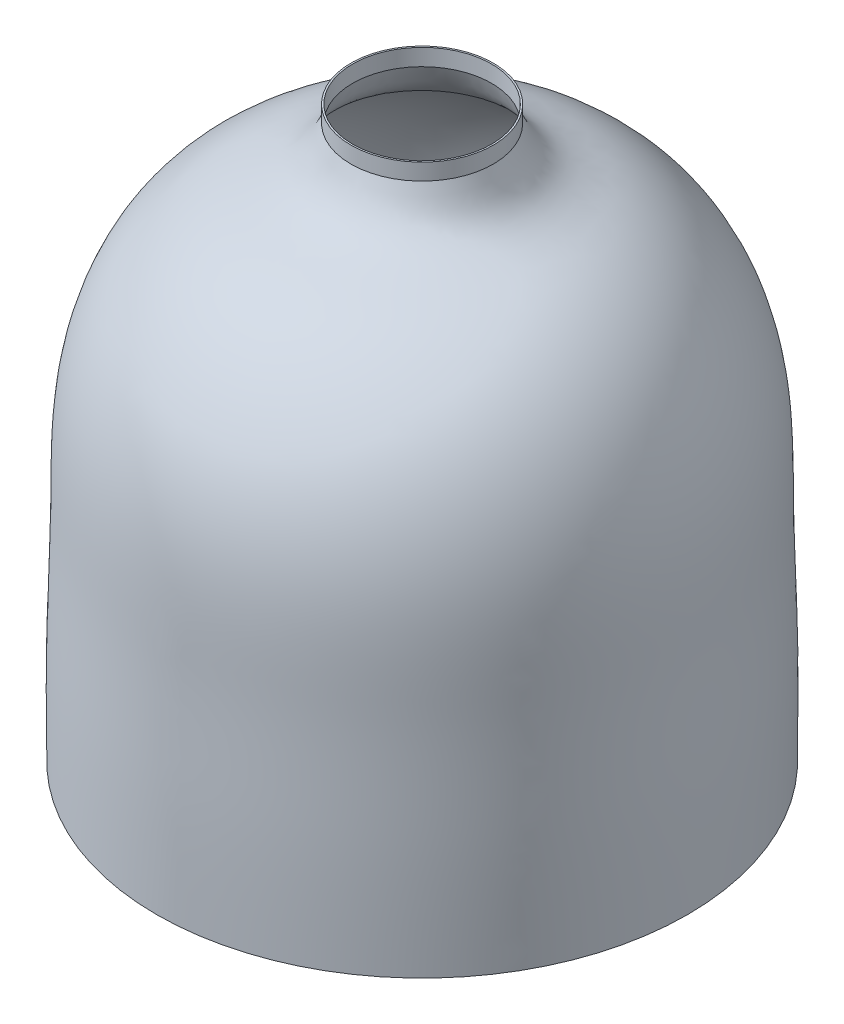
ISO-10303-21;
HEADER;
FILE_DESCRIPTION(('STEP AP214'),'2;1');
FILE_NAME('part.step','',(''),(''),'','','');
FILE_SCHEMA(('AUTOMOTIVE_DESIGN { 1 0 10303 214 1 1 1 1 }'));
ENDSEC;
DATA;
#1=APPLICATION_CONTEXT('core data for automotive mechanical design processes');
#2=APPLICATION_PROTOCOL_DEFINITION('international standard','automotive_design',2000,#1);
#3=PRODUCT_CONTEXT('',#1,'mechanical');
#4=PRODUCT('Part','Part','',(#3));
#5=PRODUCT_RELATED_PRODUCT_CATEGORY('part','',(#4));
#6=PRODUCT_DEFINITION_FORMATION('','',#4);
#7=PRODUCT_DEFINITION_CONTEXT('part definition',#1,'design');
#8=PRODUCT_DEFINITION('design','',#6,#7);
#9=PRODUCT_DEFINITION_SHAPE('','',#8);
#10=(LENGTH_UNIT() NAMED_UNIT(*) SI_UNIT(.MILLI.,.METRE.));
#11=(NAMED_UNIT(*) PLANE_ANGLE_UNIT() SI_UNIT($,.RADIAN.));
#12=(NAMED_UNIT(*) SI_UNIT($,.STERADIAN.) SOLID_ANGLE_UNIT());
#13=UNCERTAINTY_MEASURE_WITH_UNIT(LENGTH_MEASURE(1.E-05),#10,'distance_accuracy_value','');
#14=(GEOMETRIC_REPRESENTATION_CONTEXT(3) GLOBAL_UNCERTAINTY_ASSIGNED_CONTEXT((#13)) GLOBAL_UNIT_ASSIGNED_CONTEXT((#10,
#11,#12)) REPRESENTATION_CONTEXT('',''));
#15=CARTESIAN_POINT('',(0.,0.,0.));
#16=DIRECTION('',(0.,0.,1.));
#17=DIRECTION('',(1.,0.,0.));
#18=AXIS2_PLACEMENT_3D('',#15,#16,#17);
#19=CARTESIAN_POINT('',(0.,0.,0.));
#20=DIRECTION('',(0.,1.,0.));
#21=DIRECTION('',(0.,0.,1.));
#22=AXIS2_PLACEMENT_3D('',#19,#20,#21);
#23=CYLINDRICAL_SURFACE('',#22,13.);
#24=CARTESIAN_POINT('',(0.,0.,0.));
#25=DIRECTION('',(0.,1.,0.));
#26=DIRECTION('',(0.,0.,1.));
#27=AXIS2_PLACEMENT_3D('',#24,#25,#26);
#28=CIRCLE('',#27,13.);
#29=CARTESIAN_POINT('',(0.,0.,13.));
#30=VERTEX_POINT('',#29);
#31=EDGE_CURVE('E51',#30,#30,#28,.T.);
#32=ORIENTED_EDGE('',*,*,#31,.F.);
#33=EDGE_LOOP('',(#32));
#34=FACE_BOUND('',#33,.T.);
#35=CARTESIAN_POINT('',(0.,-3.,0.));
#36=DIRECTION('',(0.,1.,0.));
#37=DIRECTION('',(0.,0.,1.));
#38=AXIS2_PLACEMENT_3D('',#35,#36,#37);
#39=CIRCLE('',#38,13.);
#40=CARTESIAN_POINT('',(0.,-3.,13.));
#41=VERTEX_POINT('',#40);
#42=EDGE_CURVE('E10',#41,#41,#39,.T.);
#43=ORIENTED_EDGE('',*,*,#42,.T.);
#44=EDGE_LOOP('',(#43));
#45=FACE_BOUND('',#44,.T.);
#46=ADVANCED_FACE('F29',(#34,#45),#23,.T.);
#47=CARTESIAN_POINT('',(48.5,-104.,0.));
#48=CARTESIAN_POINT('',(48.5601417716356,-97.3319373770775,0.));
#49=CARTESIAN_POINT('',(48.6804441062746,-83.9937286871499,0.));
#50=CARTESIAN_POINT('',(47.7776787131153,-64.0042717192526,0.));
#51=CARTESIAN_POINT('',(48.2064747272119,-44.0251845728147,0.));
#52=CARTESIAN_POINT('',(41.718061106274,-25.1285380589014,0.));
#53=CARTESIAN_POINT('',(28.9379282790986,-13.6997989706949,0.));
#54=CARTESIAN_POINT('',(15.9556062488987,-10.6479940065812,0.));
#55=CARTESIAN_POINT('',(13.6968422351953,-4.80316482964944,0.));
#56=CARTESIAN_POINT('',(13.,-3.,0.));
#57=B_SPLINE_CURVE_WITH_KNOTS('',3,(#47,#48,#49,#50,#51,#52,#53,#54,#55,#56),.UNSPECIFIED.,.F.,
.F.,(4,1,1,1,1,1,1,4),(0.,0.172912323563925,0.345878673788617,0.519007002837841,
0.690017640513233,0.843340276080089,0.951669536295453,1.),.UNSPECIFIED.);
#58=CARTESIAN_POINT('',(0.,0.,0.));
#59=DIRECTION('',(0.,1.,0.));
#60=AXIS1_PLACEMENT('',#58,#59);
#61=SURFACE_OF_REVOLUTION('',#57,#60);
#62=ORIENTED_EDGE('',*,*,#42,.F.);
#63=EDGE_LOOP('',(#62));
#64=FACE_BOUND('',#63,.T.);
#65=CARTESIAN_POINT('',(0.,-104.,0.));
#66=DIRECTION('',(0.,1.,0.));
#67=DIRECTION('',(0.,0.,1.));
#68=AXIS2_PLACEMENT_3D('',#65,#66,#67);
#69=CIRCLE('',#68,48.5);
#70=CARTESIAN_POINT('',(0.,-104.,48.5));
#71=VERTEX_POINT('',#70);
#72=EDGE_CURVE('E35',#71,#71,#69,.T.);
#73=ORIENTED_EDGE('',*,*,#72,.T.);
#74=EDGE_LOOP('',(#73));
#75=FACE_BOUND('',#74,.T.);
#76=ADVANCED_FACE('F64',(#64,#75),#61,.T.);
#77=CARTESIAN_POINT('',(0.,-104.,0.));
#78=DIRECTION('',(0.,-1.,0.));
#79=DIRECTION('',(0.,0.,-1.));
#80=AXIS2_PLACEMENT_3D('',#77,#78,#79);
#81=CONICAL_SURFACE('',#80,48.5,1.56177719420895);
#82=CARTESIAN_POINT('',(0.,-103.997294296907,0.));
#83=DIRECTION('',(0.,1.,0.));
#84=DIRECTION('',(0.,0.,1.));
#85=AXIS2_PLACEMENT_3D('',#82,#83,#84);
#86=CIRCLE('',#85,48.2000122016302);
#87=CARTESIAN_POINT('',(0.,-103.997294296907,48.2000122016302));
#88=VERTEX_POINT('',#87);
#89=EDGE_CURVE('E39',#88,#88,#86,.T.);
#90=ORIENTED_EDGE('',*,*,#89,.T.);
#91=EDGE_LOOP('',(#90));
#92=FACE_BOUND('',#91,.T.);
#93=ORIENTED_EDGE('',*,*,#72,.F.);
#94=EDGE_LOOP('',(#93));
#95=FACE_BOUND('',#94,.T.);
#96=ADVANCED_FACE('F67',(#92,#95),#81,.F.);
#97=CARTESIAN_POINT('',(48.2000122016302,-103.997294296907,0.));
#98=CARTESIAN_POINT('',(48.2435095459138,-99.1746392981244,0.));
#99=CARTESIAN_POINT('',(48.286984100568,-94.353398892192,0.));
#100=CARTESIAN_POINT('',(48.249864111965,-87.1260407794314,0.));
#101=CARTESIAN_POINT('',(48.2192849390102,-84.7180573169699,0.));
#102=CARTESIAN_POINT('',(48.1123062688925,-79.9020435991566,0.));
#103=CARTESIAN_POINT('',(47.9670502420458,-75.0852195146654,0.));
#104=CARTESIAN_POINT('',(47.8212442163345,-70.2639990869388,0.));
#105=CARTESIAN_POINT('',(47.7402413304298,-66.6453941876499,0.));
#106=CARTESIAN_POINT('',(47.7179662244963,-65.4387442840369,0.));
#107=CARTESIAN_POINT('',(47.6876343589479,-63.0243749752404,0.));
#108=CARTESIAN_POINT('',(47.6801824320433,-61.8173099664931,0.));
#109=CARTESIAN_POINT('',(47.6399389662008,-55.7861154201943,0.));
#110=CARTESIAN_POINT('',(47.5969630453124,-50.9729521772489,0.));
#111=CARTESIAN_POINT('',(46.8605247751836,-45.0021047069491,0.));
#112=CARTESIAN_POINT('',(46.6785386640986,-43.8097866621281,0.));
#113=CARTESIAN_POINT('',(46.2328803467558,-41.4322331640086,0.));
#114=CARTESIAN_POINT('',(45.9701485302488,-40.2478815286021,0.));
#115=CARTESIAN_POINT('',(45.0567603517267,-36.7263071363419,0.));
#116=CARTESIAN_POINT('',(44.2808971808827,-34.4205892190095,0.));
#117=CARTESIAN_POINT('',(42.3664121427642,-29.9898237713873,0.));
#118=CARTESIAN_POINT('',(41.2278113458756,-27.8647997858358,0.));
#119=CARTESIAN_POINT('',(38.5592064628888,-23.8910558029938,0.));
#120=CARTESIAN_POINT('',(37.0281434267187,-22.0418516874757,0.));
#121=CARTESIAN_POINT('',(33.584282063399,-18.7053336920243,0.));
#122=CARTESIAN_POINT('',(31.6715676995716,-17.2180371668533,0.));
#123=CARTESIAN_POINT('',(28.5245176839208,-15.3231828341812,0.));
#124=CARTESIAN_POINT('',(27.4294460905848,-14.7477708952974,0.));
#125=CARTESIAN_POINT('',(25.1466545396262,-13.7189859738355,0.));
#126=CARTESIAN_POINT('',(23.9545102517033,-13.2614813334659,0.));
#127=CARTESIAN_POINT('',(21.5942199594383,-12.3276754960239,0.));
#128=CARTESIAN_POINT('',(20.4260139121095,-11.8514279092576,0.));
#129=CARTESIAN_POINT('',(18.2378393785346,-10.7405091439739,0.));
#130=CARTESIAN_POINT('',(17.2171734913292,-10.105552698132,0.));
#131=CARTESIAN_POINT('',(15.8967218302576,-8.92436400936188,0.));
#132=CARTESIAN_POINT('',(15.4915215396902,-8.49132232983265,0.));
#133=CARTESIAN_POINT('',(14.7722289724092,-7.53746870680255,0.));
#134=CARTESIAN_POINT('',(14.4576878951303,-7.02147067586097,0.));
#135=CARTESIAN_POINT('',(13.6029253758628,-5.40044468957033,0.));
#136=CARTESIAN_POINT('',(13.1507813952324,-4.22240406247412,0.));
#137=CARTESIAN_POINT('',(12.7,-3.05595186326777,0.));
#138=B_SPLINE_CURVE_WITH_KNOTS('',3,(#97,#98,#99,#100,#101,#102,#103,#104,#105,#106,#107,#108,
#109,#110,#111,#112,#113,#114,#115,#116,#117,#118,#119,#120,#121,#122,#123,#124,#125,#126,#127,
#128,#129,#130,#131,#132,#133,#134,#135,#136,#137),.UNSPECIFIED.,.F.,.F.,(4,2,2,1,2,2,2,2,2,2,2,
2,2,2,2,2,2,2,2,2,4),(0.,0.124999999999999,0.187499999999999,0.249999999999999,
0.312499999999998,0.343749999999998,0.374999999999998,0.499999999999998,0.531249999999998,
0.562499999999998,0.624999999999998,0.687499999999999,0.749999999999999,0.812499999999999,
0.843749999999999,0.875,0.90625,0.9375,0.953125,0.96875,1.),.UNSPECIFIED.);
#139=CARTESIAN_POINT('',(0.,0.,0.));
#140=DIRECTION('',(0.,1.,0.));
#141=AXIS1_PLACEMENT('',#139,#140);
#142=SURFACE_OF_REVOLUTION('',#138,#141);
#143=CARTESIAN_POINT('',(0.,-3.05595186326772,0.));
#144=DIRECTION('',(0.,1.,0.));
#145=DIRECTION('',(0.,0.,1.));
#146=AXIS2_PLACEMENT_3D('',#143,#144,#145);
#147=CIRCLE('',#146,12.7);
#148=CARTESIAN_POINT('',(0.,-3.05595186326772,12.7));
#149=VERTEX_POINT('',#148);
#150=EDGE_CURVE('E43',#149,#149,#147,.T.);
#151=ORIENTED_EDGE('',*,*,#150,.T.);
#152=EDGE_LOOP('',(#151));
#153=FACE_BOUND('',#152,.T.);
#154=ORIENTED_EDGE('',*,*,#89,.F.);
#155=EDGE_LOOP('',(#154));
#156=FACE_BOUND('',#155,.T.);
#157=ADVANCED_FACE('F71',(#153,#156),#142,.F.);
#158=CARTESIAN_POINT('',(0.,0.,0.));
#159=DIRECTION('',(0.,1.,0.));
#160=DIRECTION('',(0.,0.,1.));
#161=AXIS2_PLACEMENT_3D('',#158,#159,#160);
#162=CYLINDRICAL_SURFACE('',#161,12.7);
#163=CARTESIAN_POINT('',(0.,0.,0.));
#164=DIRECTION('',(0.,1.,0.));
#165=DIRECTION('',(0.,0.,1.));
#166=AXIS2_PLACEMENT_3D('',#163,#164,#165);
#167=CIRCLE('',#166,12.7);
#168=CARTESIAN_POINT('',(0.,0.,12.7));
#169=VERTEX_POINT('',#168);
#170=EDGE_CURVE('E48',#169,#169,#167,.T.);
#171=ORIENTED_EDGE('',*,*,#170,.T.);
#172=EDGE_LOOP('',(#171));
#173=FACE_BOUND('',#172,.T.);
#174=ORIENTED_EDGE('',*,*,#150,.F.);
#175=EDGE_LOOP('',(#174));
#176=FACE_BOUND('',#175,.T.);
#177=ADVANCED_FACE('F75',(#173,#176),#162,.F.);
#178=CARTESIAN_POINT('',(12.7,0.,0.));
#179=DIRECTION('',(0.,1.,0.));
#180=DIRECTION('',(0.,0.,1.));
#181=AXIS2_PLACEMENT_3D('',#178,#179,#180);
#182=PLANE('',#181);
#183=ORIENTED_EDGE('',*,*,#31,.T.);
#184=EDGE_LOOP('',(#183));
#185=FACE_BOUND('',#184,.T.);
#186=ORIENTED_EDGE('',*,*,#170,.F.);
#187=EDGE_LOOP('',(#186));
#188=FACE_BOUND('',#187,.T.);
#189=ADVANCED_FACE('F79',(#185,#188),#182,.T.);
#190=CLOSED_SHELL('',(#46,#76,#96,#157,#177,#189));
#191=MANIFOLD_SOLID_BREP('B2',#190);
#192=ADVANCED_BREP_SHAPE_REPRESENTATION('',(#18,#191),#14);
#193=SHAPE_DEFINITION_REPRESENTATION(#9,#192);
ENDSEC;
END-ISO-10303-21;
